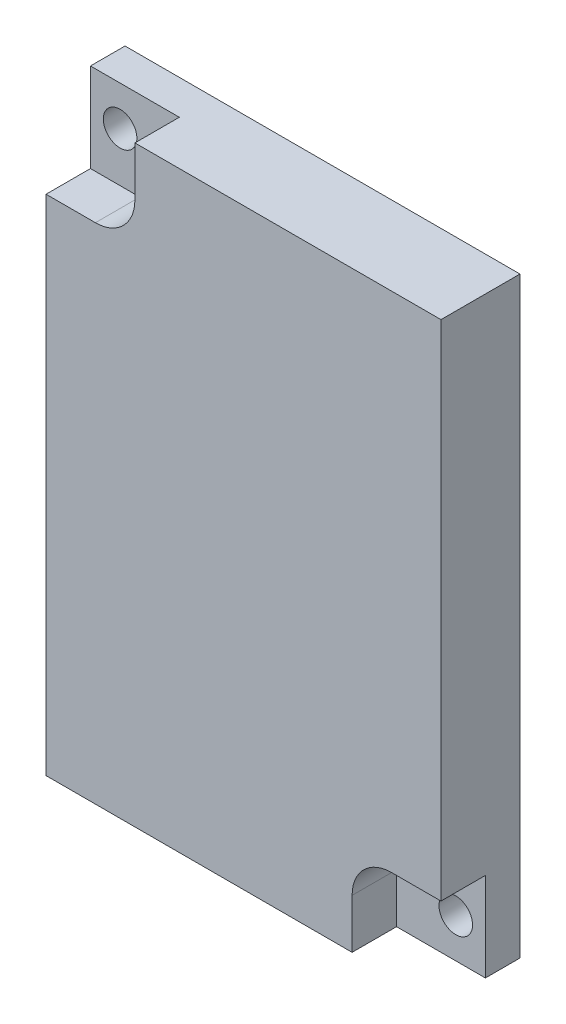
ISO-10303-21;
HEADER;
FILE_DESCRIPTION(('STEP AP214'),'2;1');
FILE_NAME('part.step','',(''),(''),'','','');
FILE_SCHEMA(('AUTOMOTIVE_DESIGN { 1 0 10303 214 1 1 1 1 }'));
ENDSEC;
DATA;
#1=APPLICATION_CONTEXT('core data for automotive mechanical design processes');
#2=APPLICATION_PROTOCOL_DEFINITION('international standard','automotive_design',2000,#1);
#3=PRODUCT_CONTEXT('',#1,'mechanical');
#4=PRODUCT('Part','Part','',(#3));
#5=PRODUCT_RELATED_PRODUCT_CATEGORY('part','',(#4));
#6=PRODUCT_DEFINITION_FORMATION('','',#4);
#7=PRODUCT_DEFINITION_CONTEXT('part definition',#1,'design');
#8=PRODUCT_DEFINITION('design','',#6,#7);
#9=PRODUCT_DEFINITION_SHAPE('','',#8);
#10=(LENGTH_UNIT() NAMED_UNIT(*) SI_UNIT(.MILLI.,.METRE.));
#11=(NAMED_UNIT(*) PLANE_ANGLE_UNIT() SI_UNIT($,.RADIAN.));
#12=(NAMED_UNIT(*) SI_UNIT($,.STERADIAN.) SOLID_ANGLE_UNIT());
#13=UNCERTAINTY_MEASURE_WITH_UNIT(LENGTH_MEASURE(1.E-05),#10,'distance_accuracy_value','');
#14=(GEOMETRIC_REPRESENTATION_CONTEXT(3) GLOBAL_UNCERTAINTY_ASSIGNED_CONTEXT((#13)) GLOBAL_UNIT_ASSIGNED_CONTEXT((#10,
#11,#12)) REPRESENTATION_CONTEXT('',''));
#15=CARTESIAN_POINT('',(0.,0.,0.));
#16=DIRECTION('',(0.,0.,1.));
#17=DIRECTION('',(1.,0.,0.));
#18=AXIS2_PLACEMENT_3D('',#15,#16,#17);
#19=CARTESIAN_POINT('',(0.,0.,7.99999999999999));
#20=DIRECTION('',(1.,0.,0.));
#21=DIRECTION('',(0.,0.,-0.999999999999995));
#22=AXIS2_PLACEMENT_3D('',#19,#20,#21);
#23=PLANE('',#22);
#24=DIRECTION('',(0.,-0.999999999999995,0.));
#25=VECTOR('',#24,1.);
#26=CARTESIAN_POINT('',(0.,0.,7.99999999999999));
#27=LINE('',#26,#25);
#28=CARTESIAN_POINT('',(0.,51.,7.99999999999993));
#29=VERTEX_POINT('',#28);
#30=CARTESIAN_POINT('',(0.,0.,7.99999999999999));
#31=VERTEX_POINT('',#30);
#32=EDGE_CURVE('E158',#29,#31,#27,.T.);
#33=ORIENTED_EDGE('',*,*,#32,.F.);
#34=DIRECTION('',(0.,0.,0.999999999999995));
#35=VECTOR('',#34,1.);
#36=CARTESIAN_POINT('',(0.,51.,3.50000000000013));
#37=LINE('',#36,#35);
#38=CARTESIAN_POINT('',(0.,51.,3.50000000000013));
#39=VERTEX_POINT('',#38);
#40=EDGE_CURVE('E252',#39,#29,#37,.T.);
#41=ORIENTED_EDGE('',*,*,#40,.F.);
#42=DIRECTION('',(0.,-0.999999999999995,0.));
#43=VECTOR('',#42,1.);
#44=CARTESIAN_POINT('',(0.,51.,3.50000000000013));
#45=LINE('',#44,#43);
#46=CARTESIAN_POINT('',(0.,60.,3.50000000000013));
#47=VERTEX_POINT('',#46);
#48=EDGE_CURVE('E240',#47,#39,#45,.T.);
#49=ORIENTED_EDGE('',*,*,#48,.F.);
#50=DIRECTION('',(0.,0.,-0.999999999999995));
#51=VECTOR('',#50,1.);
#52=CARTESIAN_POINT('',(0.,60.,7.99999999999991));
#53=LINE('',#52,#51);
#54=CARTESIAN_POINT('',(0.,60.,1.2490009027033E-13));
#55=VERTEX_POINT('',#54);
#56=EDGE_CURVE('E175',#47,#55,#53,.T.);
#57=ORIENTED_EDGE('',*,*,#56,.T.);
#58=DIRECTION('',(0.,-0.999999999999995,0.));
#59=VECTOR('',#58,1.);
#60=CARTESIAN_POINT('',(0.,0.,0.));
#61=LINE('',#60,#59);
#62=CARTESIAN_POINT('',(0.,0.,0.));
#63=VERTEX_POINT('',#62);
#64=EDGE_CURVE('E256',#55,#63,#61,.T.);
#65=ORIENTED_EDGE('',*,*,#64,.T.);
#66=DIRECTION('',(0.,0.,-0.999999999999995));
#67=VECTOR('',#66,1.);
#68=CARTESIAN_POINT('',(0.,0.,7.99999999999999));
#69=LINE('',#68,#67);
#70=EDGE_CURVE('E185',#31,#63,#69,.T.);
#71=ORIENTED_EDGE('',*,*,#70,.F.);
#72=EDGE_LOOP('',(#33,#41,#49,#57,#65,#71));
#73=FACE_BOUND('',#72,.T.);
#74=ADVANCED_FACE('F42',(#73),#23,.F.);
#75=CARTESIAN_POINT('',(0.,0.,7.99999999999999));
#76=DIRECTION('',(0.,0.999999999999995,0.));
#77=DIRECTION('',(0.,0.,0.999999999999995));
#78=AXIS2_PLACEMENT_3D('',#75,#76,#77);
#79=PLANE('',#78);
#80=DIRECTION('',(1.,0.,0.));
#81=VECTOR('',#80,1.);
#82=CARTESIAN_POINT('',(30.9999999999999,0.,3.49999999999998));
#83=LINE('',#82,#81);
#84=CARTESIAN_POINT('',(30.9999999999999,0.,3.49999999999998));
#85=VERTEX_POINT('',#84);
#86=CARTESIAN_POINT('',(40.,0.,3.49999999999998));
#87=VERTEX_POINT('',#86);
#88=EDGE_CURVE('E151',#85,#87,#83,.T.);
#89=ORIENTED_EDGE('',*,*,#88,.F.);
#90=DIRECTION('',(0.,0.,0.999999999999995));
#91=VECTOR('',#90,1.);
#92=CARTESIAN_POINT('',(30.9999999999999,0.,3.49999999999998));
#93=LINE('',#92,#91);
#94=CARTESIAN_POINT('',(30.9999999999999,0.,7.99999999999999));
#95=VERTEX_POINT('',#94);
#96=EDGE_CURVE('E135',#85,#95,#93,.T.);
#97=ORIENTED_EDGE('',*,*,#96,.T.);
#98=DIRECTION('',(1.,0.,0.));
#99=VECTOR('',#98,1.);
#100=CARTESIAN_POINT('',(0.,0.,7.99999999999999));
#101=LINE('',#100,#99);
#102=EDGE_CURVE('E148',#31,#95,#101,.T.);
#103=ORIENTED_EDGE('',*,*,#102,.F.);
#104=ORIENTED_EDGE('',*,*,#70,.T.);
#105=DIRECTION('',(1.,0.,0.));
#106=VECTOR('',#105,1.);
#107=CARTESIAN_POINT('',(0.,0.,0.));
#108=LINE('',#107,#106);
#109=CARTESIAN_POINT('',(40.,0.,0.));
#110=VERTEX_POINT('',#109);
#111=EDGE_CURVE('E262',#63,#110,#108,.T.);
#112=ORIENTED_EDGE('',*,*,#111,.T.);
#113=DIRECTION('',(0.,0.,-0.999999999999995));
#114=VECTOR('',#113,1.);
#115=CARTESIAN_POINT('',(40.,0.,7.99999999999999));
#116=LINE('',#115,#114);
#117=EDGE_CURVE('E182',#87,#110,#116,.T.);
#118=ORIENTED_EDGE('',*,*,#117,.F.);
#119=EDGE_LOOP('',(#89,#97,#103,#104,#112,#118));
#120=FACE_BOUND('',#119,.T.);
#121=ADVANCED_FACE('F146',(#120),#79,.F.);
#122=CARTESIAN_POINT('',(40.,0.,7.99999999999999));
#123=DIRECTION('',(-1.,0.,0.));
#124=DIRECTION('',(0.,0.,0.999999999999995));
#125=AXIS2_PLACEMENT_3D('',#122,#123,#124);
#126=PLANE('',#125);
#127=DIRECTION('',(0.,0.999999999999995,0.));
#128=VECTOR('',#127,1.);
#129=CARTESIAN_POINT('',(40.,0.,7.99999999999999));
#130=LINE('',#129,#128);
#131=CARTESIAN_POINT('',(40.,9.00000000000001,7.99999999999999));
#132=VERTEX_POINT('',#131);
#133=CARTESIAN_POINT('',(40.,60.,7.99999999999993));
#134=VERTEX_POINT('',#133);
#135=EDGE_CURVE('E160',#132,#134,#130,.T.);
#136=ORIENTED_EDGE('',*,*,#135,.F.);
#137=DIRECTION('',(0.,0.,0.999999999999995));
#138=VECTOR('',#137,1.);
#139=CARTESIAN_POINT('',(40.,9.00000000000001,3.5));
#140=LINE('',#139,#138);
#141=CARTESIAN_POINT('',(40.,9.00000000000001,3.5));
#142=VERTEX_POINT('',#141);
#143=EDGE_CURVE('E153',#142,#132,#140,.T.);
#144=ORIENTED_EDGE('',*,*,#143,.F.);
#145=DIRECTION('',(0.,0.999999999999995,0.));
#146=VECTOR('',#145,1.);
#147=CARTESIAN_POINT('',(40.,0.,3.49999999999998));
#148=LINE('',#147,#146);
#149=EDGE_CURVE('E225',#87,#142,#148,.T.);
#150=ORIENTED_EDGE('',*,*,#149,.F.);
#151=ORIENTED_EDGE('',*,*,#117,.T.);
#152=DIRECTION('',(0.,0.999999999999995,0.));
#153=VECTOR('',#152,1.);
#154=CARTESIAN_POINT('',(40.,0.,0.));
#155=LINE('',#154,#153);
#156=CARTESIAN_POINT('',(40.,60.,1.2490009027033E-13));
#157=VERTEX_POINT('',#156);
#158=EDGE_CURVE('E266',#110,#157,#155,.T.);
#159=ORIENTED_EDGE('',*,*,#158,.T.);
#160=DIRECTION('',(0.,0.,-0.999999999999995));
#161=VECTOR('',#160,1.);
#162=CARTESIAN_POINT('',(40.,60.,7.99999999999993));
#163=LINE('',#162,#161);
#164=EDGE_CURVE('E178',#134,#157,#163,.T.);
#165=ORIENTED_EDGE('',*,*,#164,.F.);
#166=EDGE_LOOP('',(#136,#144,#150,#151,#159,#165));
#167=FACE_BOUND('',#166,.T.);
#168=ADVANCED_FACE('F292',(#167),#126,.F.);
#169=CARTESIAN_POINT('',(0.,60.,7.99999999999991));
#170=DIRECTION('',(0.,-0.999999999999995,0.));
#171=DIRECTION('',(0.,0.,-0.999999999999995));
#172=AXIS2_PLACEMENT_3D('',#169,#170,#171);
#173=PLANE('',#172);
#174=DIRECTION('',(-1.,0.,0.));
#175=VECTOR('',#174,1.);
#176=CARTESIAN_POINT('',(0.,60.,3.50000000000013));
#177=LINE('',#176,#175);
#178=CARTESIAN_POINT('',(8.9999999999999,60.,3.50000000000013));
#179=VERTEX_POINT('',#178);
#180=EDGE_CURVE('E249',#179,#47,#177,.T.);
#181=ORIENTED_EDGE('',*,*,#180,.F.);
#182=DIRECTION('',(0.,0.,0.999999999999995));
#183=VECTOR('',#182,1.);
#184=CARTESIAN_POINT('',(8.9999999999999,60.,3.50000000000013));
#185=LINE('',#184,#183);
#186=CARTESIAN_POINT('',(8.9999999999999,60.,7.99999999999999));
#187=VERTEX_POINT('',#186);
#188=EDGE_CURVE('E253',#179,#187,#185,.T.);
#189=ORIENTED_EDGE('',*,*,#188,.T.);
#190=DIRECTION('',(-1.,0.,0.));
#191=VECTOR('',#190,1.);
#192=CARTESIAN_POINT('',(0.,60.,7.99999999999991));
#193=LINE('',#192,#191);
#194=EDGE_CURVE('E165',#134,#187,#193,.T.);
#195=ORIENTED_EDGE('',*,*,#194,.F.);
#196=ORIENTED_EDGE('',*,*,#164,.T.);
#197=DIRECTION('',(-1.,0.,0.));
#198=VECTOR('',#197,1.);
#199=CARTESIAN_POINT('',(0.,60.,1.2490009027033E-13));
#200=LINE('',#199,#198);
#201=EDGE_CURVE('E168',#157,#55,#200,.T.);
#202=ORIENTED_EDGE('',*,*,#201,.T.);
#203=ORIENTED_EDGE('',*,*,#56,.F.);
#204=EDGE_LOOP('',(#181,#189,#195,#196,#202,#203));
#205=FACE_BOUND('',#204,.T.);
#206=ADVANCED_FACE('F276',(#205),#173,.F.);
#207=CARTESIAN_POINT('',(0.,60.,7.99999999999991));
#208=DIRECTION('',(0.,0.,-0.999999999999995));
#209=DIRECTION('',(-1.,0.,0.));
#210=AXIS2_PLACEMENT_3D('',#207,#208,#209);
#211=PLANE('',#210);
#212=ORIENTED_EDGE('',*,*,#102,.T.);
#213=DIRECTION('',(0.,-0.999999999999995,0.));
#214=VECTOR('',#213,1.);
#215=CARTESIAN_POINT('',(30.9999999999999,0.,7.99999999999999));
#216=LINE('',#215,#214);
#217=CARTESIAN_POINT('',(30.9999999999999,5.,7.99999999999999));
#218=VERTEX_POINT('',#217);
#219=EDGE_CURVE('E131',#218,#95,#216,.T.);
#220=ORIENTED_EDGE('',*,*,#219,.F.);
#221=CARTESIAN_POINT('',(34.9999999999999,5.,7.99999999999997));
#222=DIRECTION('',(0.,0.,-0.999999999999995));
#223=DIRECTION('',(-1.,0.,0.));
#224=AXIS2_PLACEMENT_3D('',#221,#222,#223);
#225=CIRCLE('',#224,4.);
#226=CARTESIAN_POINT('',(34.9999999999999,9.00000000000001,7.99999999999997));
#227=VERTEX_POINT('',#226);
#228=EDGE_CURVE('E50',#218,#227,#225,.T.);
#229=ORIENTED_EDGE('',*,*,#228,.T.);
#230=DIRECTION('',(-1.,0.,0.));
#231=VECTOR('',#230,1.);
#232=CARTESIAN_POINT('',(30.9999999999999,9.00000000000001,7.99999999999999));
#233=LINE('',#232,#231);
#234=EDGE_CURVE('E141',#132,#227,#233,.T.);
#235=ORIENTED_EDGE('',*,*,#234,.F.);
#236=ORIENTED_EDGE('',*,*,#135,.T.);
#237=ORIENTED_EDGE('',*,*,#194,.T.);
#238=DIRECTION('',(0.,0.999999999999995,0.));
#239=VECTOR('',#238,1.);
#240=CARTESIAN_POINT('',(8.9999999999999,51.,7.99999999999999));
#241=LINE('',#240,#239);
#242=CARTESIAN_POINT('',(8.9999999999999,55.,7.99999999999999));
#243=VERTEX_POINT('',#242);
#244=EDGE_CURVE('E237',#243,#187,#241,.T.);
#245=ORIENTED_EDGE('',*,*,#244,.F.);
#246=CARTESIAN_POINT('',(4.99999999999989,55.,7.99999999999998));
#247=DIRECTION('',(0.,0.,-0.999999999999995));
#248=DIRECTION('',(-1.,0.,0.));
#249=AXIS2_PLACEMENT_3D('',#246,#247,#248);
#250=CIRCLE('',#249,4.);
#251=CARTESIAN_POINT('',(4.99999999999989,51.,7.99999999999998));
#252=VERTEX_POINT('',#251);
#253=EDGE_CURVE('E11',#243,#252,#250,.T.);
#254=ORIENTED_EDGE('',*,*,#253,.T.);
#255=DIRECTION('',(1.,0.,0.));
#256=VECTOR('',#255,1.);
#257=CARTESIAN_POINT('',(0.,51.,7.99999999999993));
#258=LINE('',#257,#256);
#259=EDGE_CURVE('E233',#29,#252,#258,.T.);
#260=ORIENTED_EDGE('',*,*,#259,.F.);
#261=ORIENTED_EDGE('',*,*,#32,.T.);
#262=EDGE_LOOP('',(#212,#220,#229,#235,#236,#237,#245,#254,#260,#261));
#263=FACE_BOUND('',#262,.T.);
#264=ADVANCED_FACE('F156',(#263),#211,.F.);
#265=CARTESIAN_POINT('',(0.,60.,1.2490009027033E-13));
#266=DIRECTION('',(0.,0.,-0.999999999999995));
#267=DIRECTION('',(-1.,0.,0.));
#268=AXIS2_PLACEMENT_3D('',#265,#266,#267);
#269=PLANE('',#268);
#270=CARTESIAN_POINT('',(2.99999999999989,56.,1.2490009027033E-13));
#271=DIRECTION('',(0.,0.,0.999999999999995));
#272=DIRECTION('',(1.,0.,0.));
#273=AXIS2_PLACEMENT_3D('',#270,#271,#272);
#274=CIRCLE('',#273,1.7);
#275=CARTESIAN_POINT('',(4.69999999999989,56.,1.2490009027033E-13));
#276=VERTEX_POINT('',#275);
#277=EDGE_CURVE('E452',#276,#276,#274,.T.);
#278=ORIENTED_EDGE('',*,*,#277,.T.);
#279=EDGE_LOOP('',(#278));
#280=FACE_BOUND('',#279,.T.);
#281=CARTESIAN_POINT('',(36.9999999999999,4.,0.));
#282=DIRECTION('',(0.,0.,0.999999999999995));
#283=DIRECTION('',(1.,0.,0.));
#284=AXIS2_PLACEMENT_3D('',#281,#282,#283);
#285=CIRCLE('',#284,1.7);
#286=CARTESIAN_POINT('',(38.6999999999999,4.,0.));
#287=VERTEX_POINT('',#286);
#288=EDGE_CURVE('E457',#287,#287,#285,.T.);
#289=ORIENTED_EDGE('',*,*,#288,.T.);
#290=EDGE_LOOP('',(#289));
#291=FACE_BOUND('',#290,.T.);
#292=ORIENTED_EDGE('',*,*,#64,.F.);
#293=ORIENTED_EDGE('',*,*,#201,.F.);
#294=ORIENTED_EDGE('',*,*,#158,.F.);
#295=ORIENTED_EDGE('',*,*,#111,.F.);
#296=EDGE_LOOP('',(#292,#293,#294,#295));
#297=FACE_BOUND('',#296,.T.);
#298=ADVANCED_FACE('F281',(#280,#291,#297),#269,.T.);
#299=CARTESIAN_POINT('',(8.9999999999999,51.,3.50000000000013));
#300=DIRECTION('',(1.,0.,0.));
#301=DIRECTION('',(0.,0.,-0.999999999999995));
#302=AXIS2_PLACEMENT_3D('',#299,#300,#301);
#303=PLANE('',#302);
#304=DIRECTION('',(0.,0.999999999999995,0.));
#305=VECTOR('',#304,1.);
#306=CARTESIAN_POINT('',(8.9999999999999,51.,3.50000000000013));
#307=LINE('',#306,#305);
#308=CARTESIAN_POINT('',(8.9999999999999,55.,3.50000000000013));
#309=VERTEX_POINT('',#308);
#310=EDGE_CURVE('E246',#309,#179,#307,.T.);
#311=ORIENTED_EDGE('',*,*,#310,.F.);
#312=DIRECTION('',(0.,0.,0.999999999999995));
#313=VECTOR('',#312,1.);
#314=CARTESIAN_POINT('',(8.9999999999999,55.,7.99999999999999));
#315=LINE('',#314,#313);
#316=EDGE_CURVE('E195',#309,#243,#315,.T.);
#317=ORIENTED_EDGE('',*,*,#316,.T.);
#318=ORIENTED_EDGE('',*,*,#244,.T.);
#319=ORIENTED_EDGE('',*,*,#188,.F.);
#320=EDGE_LOOP('',(#311,#317,#318,#319));
#321=FACE_BOUND('',#320,.T.);
#322=ADVANCED_FACE('F332',(#321),#303,.F.);
#323=CARTESIAN_POINT('',(0.,51.,3.50000000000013));
#324=DIRECTION('',(0.,-0.999999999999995,0.));
#325=DIRECTION('',(0.,0.,-0.999999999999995));
#326=AXIS2_PLACEMENT_3D('',#323,#324,#325);
#327=PLANE('',#326);
#328=ORIENTED_EDGE('',*,*,#259,.T.);
#329=DIRECTION('',(0.,0.,0.999999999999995));
#330=VECTOR('',#329,1.);
#331=CARTESIAN_POINT('',(4.99999999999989,51.,3.50000000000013));
#332=LINE('',#331,#330);
#333=CARTESIAN_POINT('',(4.99999999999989,51.,3.50000000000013));
#334=VERTEX_POINT('',#333);
#335=EDGE_CURVE('E57',#252,#334,#332,.F.);
#336=ORIENTED_EDGE('',*,*,#335,.T.);
#337=DIRECTION('',(1.,0.,0.));
#338=VECTOR('',#337,1.);
#339=CARTESIAN_POINT('',(0.,51.,3.50000000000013));
#340=LINE('',#339,#338);
#341=EDGE_CURVE('E244',#39,#334,#340,.T.);
#342=ORIENTED_EDGE('',*,*,#341,.F.);
#343=ORIENTED_EDGE('',*,*,#40,.T.);
#344=EDGE_LOOP('',(#328,#336,#342,#343));
#345=FACE_BOUND('',#344,.T.);
#346=ADVANCED_FACE('F341',(#345),#327,.F.);
#347=CARTESIAN_POINT('',(0.,60.,3.50000000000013));
#348=DIRECTION('',(0.,0.,-0.999999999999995));
#349=DIRECTION('',(-1.,0.,0.));
#350=AXIS2_PLACEMENT_3D('',#347,#348,#349);
#351=PLANE('',#350);
#352=CARTESIAN_POINT('',(2.99999999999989,56.,3.50000000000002));
#353=DIRECTION('',(0.,0.,0.999999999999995));
#354=DIRECTION('',(1.,0.,0.));
#355=AXIS2_PLACEMENT_3D('',#352,#353,#354);
#356=CIRCLE('',#355,1.7);
#357=CARTESIAN_POINT('',(4.69999999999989,56.,3.50000000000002));
#358=VERTEX_POINT('',#357);
#359=EDGE_CURVE('E455',#358,#358,#356,.T.);
#360=ORIENTED_EDGE('',*,*,#359,.F.);
#361=EDGE_LOOP('',(#360));
#362=FACE_BOUND('',#361,.T.);
#363=ORIENTED_EDGE('',*,*,#341,.T.);
#364=CARTESIAN_POINT('',(4.99999999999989,55.,3.50000000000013));
#365=DIRECTION('',(0.,0.,-0.999999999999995));
#366=DIRECTION('',(-1.,0.,0.));
#367=AXIS2_PLACEMENT_3D('',#364,#365,#366);
#368=CIRCLE('',#367,4.);
#369=EDGE_CURVE('E201',#334,#309,#368,.F.);
#370=ORIENTED_EDGE('',*,*,#369,.T.);
#371=ORIENTED_EDGE('',*,*,#310,.T.);
#372=ORIENTED_EDGE('',*,*,#180,.T.);
#373=ORIENTED_EDGE('',*,*,#48,.T.);
#374=EDGE_LOOP('',(#363,#370,#371,#372,#373));
#375=FACE_BOUND('',#374,.T.);
#376=ADVANCED_FACE('F286',(#362,#375),#351,.F.);
#377=CARTESIAN_POINT('',(30.9999999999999,0.,3.49999999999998));
#378=DIRECTION('',(-1.,0.,0.));
#379=DIRECTION('',(0.,0.,0.999999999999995));
#380=AXIS2_PLACEMENT_3D('',#377,#378,#379);
#381=PLANE('',#380);
#382=DIRECTION('',(0.,-0.999999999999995,0.));
#383=VECTOR('',#382,1.);
#384=CARTESIAN_POINT('',(30.9999999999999,0.,3.49999999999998));
#385=LINE('',#384,#383);
#386=CARTESIAN_POINT('',(30.9999999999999,5.,3.49999999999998));
#387=VERTEX_POINT('',#386);
#388=EDGE_CURVE('E216',#387,#85,#385,.T.);
#389=ORIENTED_EDGE('',*,*,#388,.F.);
#390=DIRECTION('',(0.,0.,0.999999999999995));
#391=VECTOR('',#390,1.);
#392=CARTESIAN_POINT('',(30.9999999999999,5.,7.99999999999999));
#393=LINE('',#392,#391);
#394=EDGE_CURVE('E138',#387,#218,#393,.T.);
#395=ORIENTED_EDGE('',*,*,#394,.T.);
#396=ORIENTED_EDGE('',*,*,#219,.T.);
#397=ORIENTED_EDGE('',*,*,#96,.F.);
#398=EDGE_LOOP('',(#389,#395,#396,#397));
#399=FACE_BOUND('',#398,.T.);
#400=ADVANCED_FACE('F134',(#399),#381,.F.);
#401=CARTESIAN_POINT('',(30.9999999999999,9.00000000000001,3.49999999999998));
#402=DIRECTION('',(0.,0.999999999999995,0.));
#403=DIRECTION('',(-1.,0.,0.));
#404=AXIS2_PLACEMENT_3D('',#401,#402,#403);
#405=PLANE('',#404);
#406=ORIENTED_EDGE('',*,*,#234,.T.);
#407=DIRECTION('',(0.,0.,0.999999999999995));
#408=VECTOR('',#407,1.);
#409=CARTESIAN_POINT('',(34.9999999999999,9.00000000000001,3.49999999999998));
#410=LINE('',#409,#408);
#411=CARTESIAN_POINT('',(34.9999999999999,9.00000000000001,3.49999999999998));
#412=VERTEX_POINT('',#411);
#413=EDGE_CURVE('E190',#227,#412,#410,.F.);
#414=ORIENTED_EDGE('',*,*,#413,.T.);
#415=DIRECTION('',(-1.,0.,0.));
#416=VECTOR('',#415,1.);
#417=CARTESIAN_POINT('',(30.9999999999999,9.00000000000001,3.49999999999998));
#418=LINE('',#417,#416);
#419=EDGE_CURVE('E154',#142,#412,#418,.T.);
#420=ORIENTED_EDGE('',*,*,#419,.F.);
#421=ORIENTED_EDGE('',*,*,#143,.T.);
#422=EDGE_LOOP('',(#406,#414,#420,#421));
#423=FACE_BOUND('',#422,.T.);
#424=ADVANCED_FACE('F211',(#423),#405,.F.);
#425=CARTESIAN_POINT('',(30.9999999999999,0.,3.49999999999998));
#426=DIRECTION('',(0.,0.,-0.999999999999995));
#427=DIRECTION('',(-1.,0.,0.));
#428=AXIS2_PLACEMENT_3D('',#425,#426,#427);
#429=PLANE('',#428);
#430=CARTESIAN_POINT('',(36.9999999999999,4.,3.49999999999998));
#431=DIRECTION('',(0.,0.,0.999999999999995));
#432=DIRECTION('',(1.,0.,0.));
#433=AXIS2_PLACEMENT_3D('',#430,#431,#432);
#434=CIRCLE('',#433,1.7);
#435=CARTESIAN_POINT('',(38.6999999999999,4.,3.49999999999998));
#436=VERTEX_POINT('',#435);
#437=EDGE_CURVE('E142',#436,#436,#434,.T.);
#438=ORIENTED_EDGE('',*,*,#437,.F.);
#439=EDGE_LOOP('',(#438));
#440=FACE_BOUND('',#439,.T.);
#441=ORIENTED_EDGE('',*,*,#419,.T.);
#442=CARTESIAN_POINT('',(34.9999999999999,5.,3.49999999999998));
#443=DIRECTION('',(0.,0.,-0.999999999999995));
#444=DIRECTION('',(-1.,0.,0.));
#445=AXIS2_PLACEMENT_3D('',#442,#443,#444);
#446=CIRCLE('',#445,4.);
#447=EDGE_CURVE('E192',#412,#387,#446,.F.);
#448=ORIENTED_EDGE('',*,*,#447,.T.);
#449=ORIENTED_EDGE('',*,*,#388,.T.);
#450=ORIENTED_EDGE('',*,*,#88,.T.);
#451=ORIENTED_EDGE('',*,*,#149,.T.);
#452=EDGE_LOOP('',(#441,#448,#449,#450,#451));
#453=FACE_BOUND('',#452,.T.);
#454=ADVANCED_FACE('F221',(#440,#453),#429,.F.);
#455=CARTESIAN_POINT('',(36.9999999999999,4.,3.49999999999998));
#456=DIRECTION('',(0.,0.,0.999999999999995));
#457=DIRECTION('',(1.,0.,0.));
#458=AXIS2_PLACEMENT_3D('',#455,#456,#457);
#459=CYLINDRICAL_SURFACE('',#458,1.7);
#460=CARTESIAN_POINT('',(38.6999999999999,4.,0.));
#461=CARTESIAN_POINT('',(38.6999999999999,4.,0.0364583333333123));
#462=CARTESIAN_POINT('',(38.6999999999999,4.,0.0729166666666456));
#463=CARTESIAN_POINT('',(38.6999999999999,4.,0.145833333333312));
#464=CARTESIAN_POINT('',(38.6999999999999,4.,0.182291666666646));
#465=CARTESIAN_POINT('',(38.6999999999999,4.,0.255208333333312));
#466=CARTESIAN_POINT('',(38.6999999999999,4.,0.291666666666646));
#467=CARTESIAN_POINT('',(38.6999999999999,4.,0.364583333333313));
#468=CARTESIAN_POINT('',(38.6999999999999,4.,0.401041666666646));
#469=CARTESIAN_POINT('',(38.6999999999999,4.,0.473958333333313));
#470=CARTESIAN_POINT('',(38.6999999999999,4.,0.510416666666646));
#471=CARTESIAN_POINT('',(38.6999999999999,4.,0.583333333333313));
#472=CARTESIAN_POINT('',(38.6999999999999,4.,0.619791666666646));
#473=CARTESIAN_POINT('',(38.6999999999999,4.,0.692708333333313));
#474=CARTESIAN_POINT('',(38.6999999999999,4.,0.729166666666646));
#475=CARTESIAN_POINT('',(38.6999999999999,4.,0.802083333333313));
#476=CARTESIAN_POINT('',(38.6999999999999,4.,0.838541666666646));
#477=CARTESIAN_POINT('',(38.6999999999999,4.,0.911458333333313));
#478=CARTESIAN_POINT('',(38.6999999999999,4.,0.947916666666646));
#479=CARTESIAN_POINT('',(38.6999999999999,4.,1.02083333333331));
#480=CARTESIAN_POINT('',(38.6999999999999,4.,1.05729166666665));
#481=CARTESIAN_POINT('',(38.6999999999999,4.,1.13020833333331));
#482=CARTESIAN_POINT('',(38.6999999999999,4.,1.16666666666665));
#483=CARTESIAN_POINT('',(38.6999999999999,4.,1.23958333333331));
#484=CARTESIAN_POINT('',(38.6999999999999,4.,1.27604166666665));
#485=CARTESIAN_POINT('',(38.6999999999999,4.,1.34895833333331));
#486=CARTESIAN_POINT('',(38.6999999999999,4.,1.38541666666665));
#487=CARTESIAN_POINT('',(38.6999999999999,4.,1.45833333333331));
#488=CARTESIAN_POINT('',(38.6999999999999,4.,1.49479166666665));
#489=CARTESIAN_POINT('',(38.6999999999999,4.,1.56770833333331));
#490=CARTESIAN_POINT('',(38.6999999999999,4.,1.60416666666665));
#491=CARTESIAN_POINT('',(38.6999999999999,4.,1.67708333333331));
#492=CARTESIAN_POINT('',(38.6999999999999,4.,1.71354166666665));
#493=CARTESIAN_POINT('',(38.6999999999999,4.,1.78645833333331));
#494=CARTESIAN_POINT('',(38.6999999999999,4.,1.82291666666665));
#495=CARTESIAN_POINT('',(38.6999999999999,4.,1.89583333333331));
#496=CARTESIAN_POINT('',(38.6999999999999,4.,1.93229166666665));
#497=CARTESIAN_POINT('',(38.6999999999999,4.,2.00520833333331));
#498=CARTESIAN_POINT('',(38.6999999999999,4.,2.04166666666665));
#499=CARTESIAN_POINT('',(38.6999999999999,4.,2.11458333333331));
#500=CARTESIAN_POINT('',(38.6999999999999,4.,2.15104166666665));
#501=CARTESIAN_POINT('',(38.6999999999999,4.,2.22395833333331));
#502=CARTESIAN_POINT('',(38.6999999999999,4.,2.26041666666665));
#503=CARTESIAN_POINT('',(38.6999999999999,4.,2.33333333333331));
#504=CARTESIAN_POINT('',(38.6999999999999,4.,2.36979166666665));
#505=CARTESIAN_POINT('',(38.6999999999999,4.,2.44270833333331));
#506=CARTESIAN_POINT('',(38.6999999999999,4.,2.47916666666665));
#507=CARTESIAN_POINT('',(38.6999999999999,4.,2.55208333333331));
#508=CARTESIAN_POINT('',(38.6999999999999,4.,2.58854166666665));
#509=CARTESIAN_POINT('',(38.6999999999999,4.,2.66145833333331));
#510=CARTESIAN_POINT('',(38.6999999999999,4.,2.69791666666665));
#511=CARTESIAN_POINT('',(38.6999999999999,4.,2.77083333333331));
#512=CARTESIAN_POINT('',(38.6999999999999,4.,2.80729166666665));
#513=CARTESIAN_POINT('',(38.6999999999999,4.,2.88020833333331));
#514=CARTESIAN_POINT('',(38.6999999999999,4.,2.91666666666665));
#515=CARTESIAN_POINT('',(38.6999999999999,4.,2.98958333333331));
#516=CARTESIAN_POINT('',(38.6999999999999,4.,3.02604166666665));
#517=CARTESIAN_POINT('',(38.6999999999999,4.,3.09895833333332));
#518=CARTESIAN_POINT('',(38.6999999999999,4.,3.13541666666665));
#519=CARTESIAN_POINT('',(38.6999999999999,4.,3.20833333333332));
#520=CARTESIAN_POINT('',(38.6999999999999,4.,3.24479166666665));
#521=CARTESIAN_POINT('',(38.6999999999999,4.,3.31770833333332));
#522=CARTESIAN_POINT('',(38.6999999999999,4.,3.35416666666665));
#523=CARTESIAN_POINT('',(38.6999999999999,4.,3.42708333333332));
#524=CARTESIAN_POINT('',(38.6999999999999,4.,3.46354166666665));
#525=CARTESIAN_POINT('',(38.6999999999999,4.,3.49999999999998));
#526=B_SPLINE_CURVE_WITH_KNOTS('',3,(#460,#461,#462,#463,#464,#465,#466,#467,#468,#469,#470,
#471,#472,#473,#474,#475,#476,#477,#478,#479,#480,#481,#482,#483,#484,#485,#486,#487,#488,#489,
#490,#491,#492,#493,#494,#495,#496,#497,#498,#499,#500,#501,#502,#503,#504,#505,#506,#507,#508,
#509,#510,#511,#512,#513,#514,#515,#516,#517,#518,#519,#520,#521,#522,#523,#524,#525),
.UNSPECIFIED.,.F.,.F.,(4,2,2,2,2,2,2,2,2,2,2,2,2,2,2,2,2,2,2,2,2,2,2,2,2,2,2,2,2,2,2,2,4),(0.,
0.109375,0.21875,0.328125,0.4375,0.546875,0.656250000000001,0.765625,0.875000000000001,0.984375,
1.09375,1.203125,1.3125,1.421875,1.53125,1.640625,1.75,1.859375,1.96875,2.078125,2.1875,
2.296875,2.40625,2.515625,2.625,2.734375,2.84375,2.953125,3.0625,3.171875,3.28125,3.390625,3.5),.UNSPECIFIED.);
#527=EDGE_CURVE('BSEAM378',#287,#436,#526,.T.);
#528=ORIENTED_EDGE('',*,*,#288,.F.);
#529=ORIENTED_EDGE('',*,*,#437,.T.);
#530=ORIENTED_EDGE('',*,*,#527,.T.);
#531=ORIENTED_EDGE('',*,*,#527,.F.);
#532=EDGE_LOOP('',(#528,#530,#529,#531));
#533=FACE_BOUND('',#532,.T.);
#534=ADVANCED_FACE('F378',(#533),#459,.F.);
#535=CARTESIAN_POINT('',(2.99999999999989,56.,3.50000000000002));
#536=DIRECTION('',(0.,0.,0.999999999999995));
#537=DIRECTION('',(1.,0.,0.));
#538=AXIS2_PLACEMENT_3D('',#535,#536,#537);
#539=CYLINDRICAL_SURFACE('',#538,1.7);
#540=CARTESIAN_POINT('',(4.69999999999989,56.,1.2490009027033E-13));
#541=CARTESIAN_POINT('',(4.69999999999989,56.,0.036458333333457));
#542=CARTESIAN_POINT('',(4.69999999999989,56.,0.072916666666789));
#543=CARTESIAN_POINT('',(4.69999999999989,56.,0.145833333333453));
#544=CARTESIAN_POINT('',(4.69999999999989,56.,0.182291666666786));
#545=CARTESIAN_POINT('',(4.69999999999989,56.,0.25520833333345));
#546=CARTESIAN_POINT('',(4.69999999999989,56.,0.291666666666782));
#547=CARTESIAN_POINT('',(4.69999999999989,56.,0.364583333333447));
#548=CARTESIAN_POINT('',(4.69999999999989,56.,0.401041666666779));
#549=CARTESIAN_POINT('',(4.69999999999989,56.,0.473958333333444));
#550=CARTESIAN_POINT('',(4.69999999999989,56.,0.510416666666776));
#551=CARTESIAN_POINT('',(4.69999999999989,56.,0.58333333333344));
#552=CARTESIAN_POINT('',(4.69999999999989,56.,0.619791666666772));
#553=CARTESIAN_POINT('',(4.69999999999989,56.,0.692708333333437));
#554=CARTESIAN_POINT('',(4.69999999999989,56.,0.729166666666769));
#555=CARTESIAN_POINT('',(4.69999999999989,56.,0.802083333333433));
#556=CARTESIAN_POINT('',(4.69999999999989,56.,0.838541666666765));
#557=CARTESIAN_POINT('',(4.69999999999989,56.,0.91145833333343));
#558=CARTESIAN_POINT('',(4.69999999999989,56.,0.947916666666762));
#559=CARTESIAN_POINT('',(4.69999999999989,56.,1.02083333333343));
#560=CARTESIAN_POINT('',(4.69999999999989,56.,1.05729166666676));
#561=CARTESIAN_POINT('',(4.69999999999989,56.,1.13020833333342));
#562=CARTESIAN_POINT('',(4.69999999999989,56.,1.16666666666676));
#563=CARTESIAN_POINT('',(4.69999999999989,56.,1.23958333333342));
#564=CARTESIAN_POINT('',(4.69999999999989,56.,1.27604166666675));
#565=CARTESIAN_POINT('',(4.69999999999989,56.,1.34895833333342));
#566=CARTESIAN_POINT('',(4.69999999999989,56.,1.38541666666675));
#567=CARTESIAN_POINT('',(4.69999999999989,56.,1.45833333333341));
#568=CARTESIAN_POINT('',(4.69999999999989,56.,1.49479166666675));
#569=CARTESIAN_POINT('',(4.69999999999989,56.,1.56770833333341));
#570=CARTESIAN_POINT('',(4.69999999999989,56.,1.60416666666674));
#571=CARTESIAN_POINT('',(4.69999999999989,56.,1.67708333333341));
#572=CARTESIAN_POINT('',(4.69999999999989,56.,1.71354166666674));
#573=CARTESIAN_POINT('',(4.69999999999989,56.,1.7864583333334));
#574=CARTESIAN_POINT('',(4.69999999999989,56.,1.82291666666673));
#575=CARTESIAN_POINT('',(4.69999999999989,56.,1.8958333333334));
#576=CARTESIAN_POINT('',(4.69999999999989,56.,1.93229166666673));
#577=CARTESIAN_POINT('',(4.69999999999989,56.,2.0052083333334));
#578=CARTESIAN_POINT('',(4.69999999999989,56.,2.04166666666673));
#579=CARTESIAN_POINT('',(4.69999999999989,56.,2.11458333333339));
#580=CARTESIAN_POINT('',(4.69999999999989,56.,2.15104166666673));
#581=CARTESIAN_POINT('',(4.69999999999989,56.,2.22395833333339));
#582=CARTESIAN_POINT('',(4.69999999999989,56.,2.26041666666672));
#583=CARTESIAN_POINT('',(4.69999999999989,56.,2.33333333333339));
#584=CARTESIAN_POINT('',(4.69999999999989,56.,2.36979166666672));
#585=CARTESIAN_POINT('',(4.69999999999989,56.,2.44270833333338));
#586=CARTESIAN_POINT('',(4.69999999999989,56.,2.47916666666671));
#587=CARTESIAN_POINT('',(4.69999999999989,56.,2.55208333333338));
#588=CARTESIAN_POINT('',(4.69999999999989,56.,2.58854166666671));
#589=CARTESIAN_POINT('',(4.69999999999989,56.,2.66145833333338));
#590=CARTESIAN_POINT('',(4.69999999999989,56.,2.69791666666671));
#591=CARTESIAN_POINT('',(4.69999999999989,56.,2.77083333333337));
#592=CARTESIAN_POINT('',(4.69999999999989,56.,2.8072916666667));
#593=CARTESIAN_POINT('',(4.69999999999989,56.,2.88020833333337));
#594=CARTESIAN_POINT('',(4.69999999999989,56.,2.9166666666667));
#595=CARTESIAN_POINT('',(4.69999999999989,56.,2.98958333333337));
#596=CARTESIAN_POINT('',(4.69999999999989,56.,3.0260416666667));
#597=CARTESIAN_POINT('',(4.69999999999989,56.,3.09895833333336));
#598=CARTESIAN_POINT('',(4.69999999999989,56.,3.13541666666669));
#599=CARTESIAN_POINT('',(4.69999999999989,56.,3.20833333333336));
#600=CARTESIAN_POINT('',(4.69999999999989,56.,3.24479166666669));
#601=CARTESIAN_POINT('',(4.69999999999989,56.,3.31770833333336));
#602=CARTESIAN_POINT('',(4.69999999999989,56.,3.35416666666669));
#603=CARTESIAN_POINT('',(4.69999999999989,56.,3.42708333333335));
#604=CARTESIAN_POINT('',(4.69999999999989,56.,3.46354166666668));
#605=CARTESIAN_POINT('',(4.69999999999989,56.,3.50000000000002));
#606=B_SPLINE_CURVE_WITH_KNOTS('',3,(#540,#541,#542,#543,#544,#545,#546,#547,#548,#549,#550,
#551,#552,#553,#554,#555,#556,#557,#558,#559,#560,#561,#562,#563,#564,#565,#566,#567,#568,#569,
#570,#571,#572,#573,#574,#575,#576,#577,#578,#579,#580,#581,#582,#583,#584,#585,#586,#587,#588,
#589,#590,#591,#592,#593,#594,#595,#596,#597,#598,#599,#600,#601,#602,#603,#604,#605),
.UNSPECIFIED.,.F.,.F.,(4,2,2,2,2,2,2,2,2,2,2,2,2,2,2,2,2,2,2,2,2,2,2,2,2,2,2,2,2,2,2,2,4),(0.,
0.109374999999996,0.218749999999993,0.32812499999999,0.437499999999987,0.546874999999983,
0.65624999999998,0.765624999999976,0.874999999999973,0.984374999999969,1.09374999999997,
1.20312499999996,1.31249999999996,1.42187499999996,1.53124999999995,1.64062499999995,
1.74999999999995,1.85937499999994,1.96874999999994,2.07812499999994,2.18749999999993,
2.29687499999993,2.40624999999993,2.51562499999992,2.62499999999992,2.73437499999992,
2.84374999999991,2.95312499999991,3.0624999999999,3.1718749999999,3.2812499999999,
3.3906249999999,3.49999999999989),.UNSPECIFIED.);
#607=EDGE_CURVE('BSEAM387',#276,#358,#606,.T.);
#608=ORIENTED_EDGE('',*,*,#277,.F.);
#609=ORIENTED_EDGE('',*,*,#359,.T.);
#610=ORIENTED_EDGE('',*,*,#607,.T.);
#611=ORIENTED_EDGE('',*,*,#607,.F.);
#612=EDGE_LOOP('',(#608,#610,#609,#611));
#613=FACE_BOUND('',#612,.T.);
#614=ADVANCED_FACE('F387',(#613),#539,.F.);
#615=CARTESIAN_POINT('',(34.9999999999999,5.,3.49999999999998));
#616=DIRECTION('',(0.,0.,-0.999999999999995));
#617=DIRECTION('',(-1.,0.,0.));
#618=AXIS2_PLACEMENT_3D('',#615,#616,#617);
#619=CYLINDRICAL_SURFACE('',#618,4.);
#620=ORIENTED_EDGE('',*,*,#447,.F.);
#621=ORIENTED_EDGE('',*,*,#413,.F.);
#622=ORIENTED_EDGE('',*,*,#228,.F.);
#623=ORIENTED_EDGE('',*,*,#394,.F.);
#624=EDGE_LOOP('',(#620,#621,#622,#623));
#625=FACE_BOUND('',#624,.T.);
#626=ADVANCED_FACE('F219',(#625),#619,.F.);
#627=CARTESIAN_POINT('',(4.99999999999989,55.,3.50000000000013));
#628=DIRECTION('',(0.,0.,-0.999999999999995));
#629=DIRECTION('',(-1.,0.,0.));
#630=AXIS2_PLACEMENT_3D('',#627,#628,#629);
#631=CYLINDRICAL_SURFACE('',#630,4.);
#632=ORIENTED_EDGE('',*,*,#369,.F.);
#633=ORIENTED_EDGE('',*,*,#335,.F.);
#634=ORIENTED_EDGE('',*,*,#253,.F.);
#635=ORIENTED_EDGE('',*,*,#316,.F.);
#636=EDGE_LOOP('',(#632,#633,#634,#635));
#637=FACE_BOUND('',#636,.T.);
#638=ADVANCED_FACE('F404',(#637),#631,.F.);
#639=CLOSED_SHELL('',(#74,#121,#168,#206,#264,#298,#322,#346,#376,#400,#424,#454,#534,#614,#626,#638));
#640=MANIFOLD_SOLID_BREP('B2',#639);
#641=ADVANCED_BREP_SHAPE_REPRESENTATION('',(#18,#640),#14);
#642=SHAPE_DEFINITION_REPRESENTATION(#9,#641);
ENDSEC;
END-ISO-10303-21;
